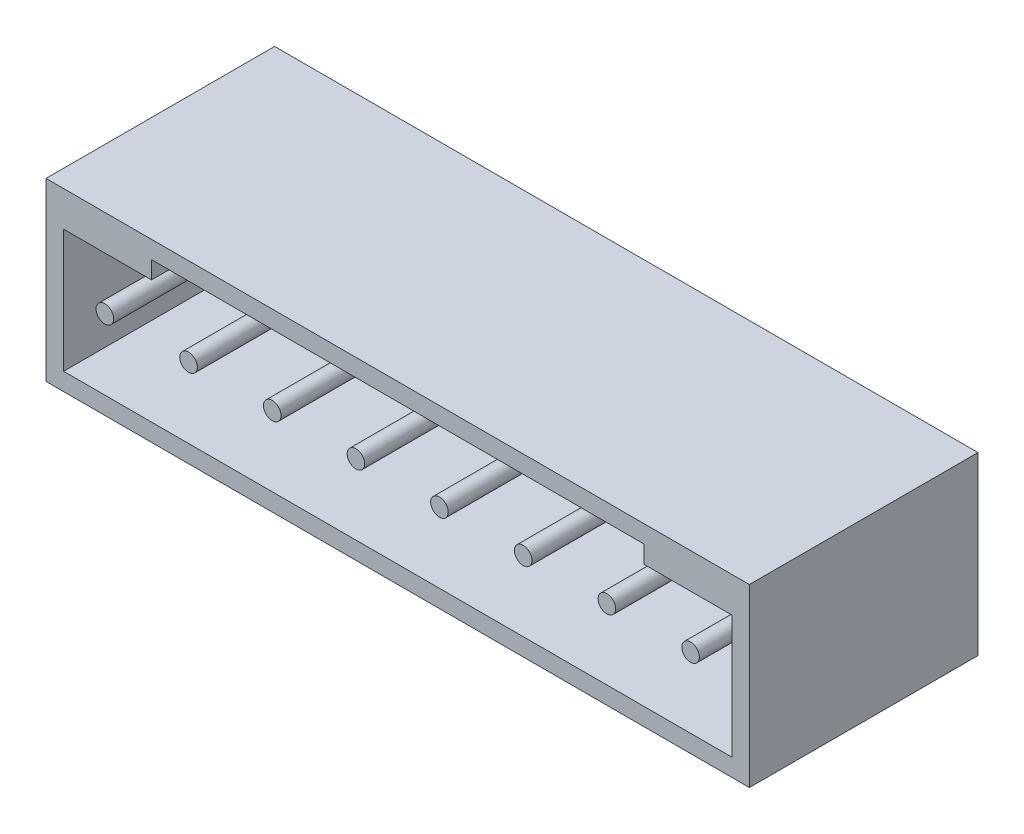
ISO-10303-21;
HEADER;
FILE_DESCRIPTION(('STEP AP214'),'2;1');
FILE_NAME('part.step','',(''),(''),'','','');
FILE_SCHEMA(('AUTOMOTIVE_DESIGN { 1 0 10303 214 1 1 1 1 }'));
ENDSEC;
DATA;
#1=APPLICATION_CONTEXT('core data for automotive mechanical design processes');
#2=APPLICATION_PROTOCOL_DEFINITION('international standard','automotive_design',2000,#1);
#3=PRODUCT_CONTEXT('',#1,'mechanical');
#4=PRODUCT('Part','Part','',(#3));
#5=PRODUCT_RELATED_PRODUCT_CATEGORY('part','',(#4));
#6=PRODUCT_DEFINITION_FORMATION('','',#4);
#7=PRODUCT_DEFINITION_CONTEXT('part definition',#1,'design');
#8=PRODUCT_DEFINITION('design','',#6,#7);
#9=PRODUCT_DEFINITION_SHAPE('','',#8);
#10=(LENGTH_UNIT() NAMED_UNIT(*) SI_UNIT(.MILLI.,.METRE.));
#11=(NAMED_UNIT(*) PLANE_ANGLE_UNIT() SI_UNIT($,.RADIAN.));
#12=(NAMED_UNIT(*) SI_UNIT($,.STERADIAN.) SOLID_ANGLE_UNIT());
#13=UNCERTAINTY_MEASURE_WITH_UNIT(LENGTH_MEASURE(1.E-05),#10,'distance_accuracy_value','');
#14=(GEOMETRIC_REPRESENTATION_CONTEXT(3) GLOBAL_UNCERTAINTY_ASSIGNED_CONTEXT((#13)) GLOBAL_UNIT_ASSIGNED_CONTEXT((#10,
#11,#12)) REPRESENTATION_CONTEXT('',''));
#15=CARTESIAN_POINT('',(0.,0.,0.));
#16=DIRECTION('',(0.,0.,1.));
#17=DIRECTION('',(1.,0.,0.));
#18=AXIS2_PLACEMENT_3D('',#15,#16,#17);
#19=CARTESIAN_POINT('',(0.,0.,6.));
#20=DIRECTION('',(0.,0.,1.));
#21=DIRECTION('',(1.,0.,0.));
#22=AXIS2_PLACEMENT_3D('',#19,#20,#21);
#23=PLANE('',#22);
#24=DIRECTION('',(0.,1.,0.));
#25=VECTOR('',#24,1.);
#26=CARTESIAN_POINT('',(10.,2.5,6.));
#27=LINE('',#26,#25);
#28=CARTESIAN_POINT('',(10.,-2.5,6.));
#29=VERTEX_POINT('',#28);
#30=CARTESIAN_POINT('',(10.,2.5,6.));
#31=VERTEX_POINT('',#30);
#32=EDGE_CURVE('E129',#29,#31,#27,.T.);
#33=ORIENTED_EDGE('',*,*,#32,.T.);
#34=DIRECTION('',(-1.,0.,0.));
#35=VECTOR('',#34,1.);
#36=CARTESIAN_POINT('',(-9.99999999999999,2.5,6.));
#37=LINE('',#36,#35);
#38=CARTESIAN_POINT('',(-9.99999999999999,2.5,6.));
#39=VERTEX_POINT('',#38);
#40=EDGE_CURVE('E212',#31,#39,#37,.T.);
#41=ORIENTED_EDGE('',*,*,#40,.T.);
#42=DIRECTION('',(0.,-1.,0.));
#43=VECTOR('',#42,1.);
#44=CARTESIAN_POINT('',(-9.99999999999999,2.5,6.));
#45=LINE('',#44,#43);
#46=CARTESIAN_POINT('',(-10.,-2.5,6.));
#47=VERTEX_POINT('',#46);
#48=EDGE_CURVE('E214',#39,#47,#45,.T.);
#49=ORIENTED_EDGE('',*,*,#48,.T.);
#50=DIRECTION('',(1.,0.,0.));
#51=VECTOR('',#50,1.);
#52=CARTESIAN_POINT('',(-10.,-2.5,6.));
#53=LINE('',#52,#51);
#54=EDGE_CURVE('E57',#47,#29,#53,.T.);
#55=ORIENTED_EDGE('',*,*,#54,.T.);
#56=EDGE_LOOP('',(#33,#41,#49,#55));
#57=FACE_BOUND('',#56,.T.);
#58=DIRECTION('',(0.,1.,0.));
#59=VECTOR('',#58,1.);
#60=CARTESIAN_POINT('',(9.5,-2.,6.));
#61=LINE('',#60,#59);
#62=CARTESIAN_POINT('',(9.5,-2.,6.));
#63=VERTEX_POINT('',#62);
#64=CARTESIAN_POINT('',(9.5,1.5,6.));
#65=VERTEX_POINT('',#64);
#66=EDGE_CURVE('E158',#63,#65,#61,.T.);
#67=ORIENTED_EDGE('',*,*,#66,.F.);
#68=DIRECTION('',(1.,0.,0.));
#69=VECTOR('',#68,1.);
#70=CARTESIAN_POINT('',(-9.5,-2.,6.));
#71=LINE('',#70,#69);
#72=CARTESIAN_POINT('',(-9.5,-2.,6.));
#73=VERTEX_POINT('',#72);
#74=EDGE_CURVE('E156',#73,#63,#71,.T.);
#75=ORIENTED_EDGE('',*,*,#74,.F.);
#76=DIRECTION('',(0.,-1.,0.));
#77=VECTOR('',#76,1.);
#78=CARTESIAN_POINT('',(-9.5,-2.,6.));
#79=LINE('',#78,#77);
#80=CARTESIAN_POINT('',(-9.5,1.5,6.));
#81=VERTEX_POINT('',#80);
#82=EDGE_CURVE('E171',#81,#73,#79,.T.);
#83=ORIENTED_EDGE('',*,*,#82,.F.);
#84=DIRECTION('',(-1.,0.,0.));
#85=VECTOR('',#84,1.);
#86=CARTESIAN_POINT('',(-9.5,1.5,6.));
#87=LINE('',#86,#85);
#88=CARTESIAN_POINT('',(-7.,1.5,6.));
#89=VERTEX_POINT('',#88);
#90=EDGE_CURVE('E169',#89,#81,#87,.T.);
#91=ORIENTED_EDGE('',*,*,#90,.F.);
#92=DIRECTION('',(0.,-1.,0.));
#93=VECTOR('',#92,1.);
#94=CARTESIAN_POINT('',(-7.,1.5,6.));
#95=LINE('',#94,#93);
#96=CARTESIAN_POINT('',(-7.,2.,6.));
#97=VERTEX_POINT('',#96);
#98=EDGE_CURVE('E167',#97,#89,#95,.T.);
#99=ORIENTED_EDGE('',*,*,#98,.F.);
#100=DIRECTION('',(-1.,0.,0.));
#101=VECTOR('',#100,1.);
#102=CARTESIAN_POINT('',(-7.,2.,6.));
#103=LINE('',#102,#101);
#104=CARTESIAN_POINT('',(7.,2.,6.));
#105=VERTEX_POINT('',#104);
#106=EDGE_CURVE('E165',#105,#97,#103,.T.);
#107=ORIENTED_EDGE('',*,*,#106,.F.);
#108=DIRECTION('',(0.,1.,0.));
#109=VECTOR('',#108,1.);
#110=CARTESIAN_POINT('',(7.,1.5,6.));
#111=LINE('',#110,#109);
#112=CARTESIAN_POINT('',(7.,1.5,6.));
#113=VERTEX_POINT('',#112);
#114=EDGE_CURVE('E163',#113,#105,#111,.T.);
#115=ORIENTED_EDGE('',*,*,#114,.F.);
#116=DIRECTION('',(-1.,0.,0.));
#117=VECTOR('',#116,1.);
#118=CARTESIAN_POINT('',(9.5,1.5,6.));
#119=LINE('',#118,#117);
#120=EDGE_CURVE('E161',#65,#113,#119,.T.);
#121=ORIENTED_EDGE('',*,*,#120,.F.);
#122=EDGE_LOOP('',(#67,#75,#83,#91,#99,#107,#115,#121));
#123=FACE_BOUND('',#122,.T.);
#124=ADVANCED_FACE('F34',(#57,#123),#23,.T.);
#125=CARTESIAN_POINT('',(10.,2.5,6.));
#126=DIRECTION('',(-1.,0.,0.));
#127=DIRECTION('',(0.,-1.,0.));
#128=AXIS2_PLACEMENT_3D('',#125,#126,#127);
#129=PLANE('',#128);
#130=DIRECTION('',(0.,0.,-1.));
#131=VECTOR('',#130,1.);
#132=CARTESIAN_POINT('',(10.,-2.5,6.));
#133=LINE('',#132,#131);
#134=CARTESIAN_POINT('',(10.,-2.5,-0.5));
#135=VERTEX_POINT('',#134);
#136=EDGE_CURVE('E124',#29,#135,#133,.T.);
#137=ORIENTED_EDGE('',*,*,#136,.T.);
#138=DIRECTION('',(0.,-1.,0.));
#139=VECTOR('',#138,1.);
#140=CARTESIAN_POINT('',(10.,2.5,-0.5));
#141=LINE('',#140,#139);
#142=CARTESIAN_POINT('',(10.,2.5,-0.5));
#143=VERTEX_POINT('',#142);
#144=EDGE_CURVE('E128',#143,#135,#141,.T.);
#145=ORIENTED_EDGE('',*,*,#144,.F.);
#146=DIRECTION('',(0.,0.,-1.));
#147=VECTOR('',#146,1.);
#148=CARTESIAN_POINT('',(10.,2.5,6.));
#149=LINE('',#148,#147);
#150=EDGE_CURVE('E220',#31,#143,#149,.T.);
#151=ORIENTED_EDGE('',*,*,#150,.F.);
#152=ORIENTED_EDGE('',*,*,#32,.F.);
#153=EDGE_LOOP('',(#137,#145,#151,#152));
#154=FACE_BOUND('',#153,.T.);
#155=ADVANCED_FACE('F36',(#154),#129,.F.);
#156=CARTESIAN_POINT('',(-9.99999999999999,2.5,6.));
#157=DIRECTION('',(0.,-1.,0.));
#158=DIRECTION('',(0.,0.,-1.));
#159=AXIS2_PLACEMENT_3D('',#156,#157,#158);
#160=PLANE('',#159);
#161=ORIENTED_EDGE('',*,*,#150,.T.);
#162=DIRECTION('',(1.,0.,0.));
#163=VECTOR('',#162,1.);
#164=CARTESIAN_POINT('',(10.,2.5,-0.5));
#165=LINE('',#164,#163);
#166=CARTESIAN_POINT('',(-10.,2.5,-0.5));
#167=VERTEX_POINT('',#166);
#168=EDGE_CURVE('E145',#167,#143,#165,.T.);
#169=ORIENTED_EDGE('',*,*,#168,.F.);
#170=DIRECTION('',(0.,0.,-1.));
#171=VECTOR('',#170,1.);
#172=CARTESIAN_POINT('',(-9.99999999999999,2.5,6.));
#173=LINE('',#172,#171);
#174=EDGE_CURVE('E218',#39,#167,#173,.T.);
#175=ORIENTED_EDGE('',*,*,#174,.F.);
#176=ORIENTED_EDGE('',*,*,#40,.F.);
#177=EDGE_LOOP('',(#161,#169,#175,#176));
#178=FACE_BOUND('',#177,.T.);
#179=ADVANCED_FACE('F309',(#178),#160,.F.);
#180=CARTESIAN_POINT('',(-9.99999999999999,2.5,6.));
#181=DIRECTION('',(1.,0.,0.));
#182=DIRECTION('',(0.,1.,0.));
#183=AXIS2_PLACEMENT_3D('',#180,#181,#182);
#184=PLANE('',#183);
#185=ORIENTED_EDGE('',*,*,#174,.T.);
#186=DIRECTION('',(0.,1.,0.));
#187=VECTOR('',#186,1.);
#188=CARTESIAN_POINT('',(-10.,2.5,-0.5));
#189=LINE('',#188,#187);
#190=CARTESIAN_POINT('',(-10.,-2.5,-0.5));
#191=VERTEX_POINT('',#190);
#192=EDGE_CURVE('E140',#191,#167,#189,.T.);
#193=ORIENTED_EDGE('',*,*,#192,.F.);
#194=DIRECTION('',(0.,0.,-1.));
#195=VECTOR('',#194,1.);
#196=CARTESIAN_POINT('',(-10.,-2.5,6.));
#197=LINE('',#196,#195);
#198=EDGE_CURVE('E131',#47,#191,#197,.T.);
#199=ORIENTED_EDGE('',*,*,#198,.F.);
#200=ORIENTED_EDGE('',*,*,#48,.F.);
#201=EDGE_LOOP('',(#185,#193,#199,#200));
#202=FACE_BOUND('',#201,.T.);
#203=ADVANCED_FACE('F315',(#202),#184,.F.);
#204=CARTESIAN_POINT('',(-10.,-2.5,6.));
#205=DIRECTION('',(0.,1.,0.));
#206=DIRECTION('',(0.,0.,1.));
#207=AXIS2_PLACEMENT_3D('',#204,#205,#206);
#208=PLANE('',#207);
#209=ORIENTED_EDGE('',*,*,#198,.T.);
#210=DIRECTION('',(-1.,0.,0.));
#211=VECTOR('',#210,1.);
#212=CARTESIAN_POINT('',(10.,-2.5,-0.5));
#213=LINE('',#212,#211);
#214=EDGE_CURVE('E134',#135,#191,#213,.T.);
#215=ORIENTED_EDGE('',*,*,#214,.F.);
#216=ORIENTED_EDGE('',*,*,#136,.F.);
#217=ORIENTED_EDGE('',*,*,#54,.F.);
#218=EDGE_LOOP('',(#209,#215,#216,#217));
#219=FACE_BOUND('',#218,.T.);
#220=ADVANCED_FACE('F135',(#219),#208,.F.);
#221=CARTESIAN_POINT('',(-9.5,-2.,6.));
#222=DIRECTION('',(0.,1.,0.));
#223=DIRECTION('',(0.,0.,1.));
#224=AXIS2_PLACEMENT_3D('',#221,#222,#223);
#225=PLANE('',#224);
#226=DIRECTION('',(1.,0.,0.));
#227=VECTOR('',#226,1.);
#228=CARTESIAN_POINT('',(-9.5,-2.,0.));
#229=LINE('',#228,#227);
#230=CARTESIAN_POINT('',(-9.5,-2.,0.));
#231=VERTEX_POINT('',#230);
#232=CARTESIAN_POINT('',(9.5,-2.,0.));
#233=VERTEX_POINT('',#232);
#234=EDGE_CURVE('E155',#231,#233,#229,.T.);
#235=ORIENTED_EDGE('',*,*,#234,.F.);
#236=DIRECTION('',(0.,0.,-1.));
#237=VECTOR('',#236,1.);
#238=CARTESIAN_POINT('',(-9.5,-2.,6.));
#239=LINE('',#238,#237);
#240=EDGE_CURVE('E173',#73,#231,#239,.T.);
#241=ORIENTED_EDGE('',*,*,#240,.F.);
#242=ORIENTED_EDGE('',*,*,#74,.T.);
#243=DIRECTION('',(0.,0.,-1.));
#244=VECTOR('',#243,1.);
#245=CARTESIAN_POINT('',(9.5,-2.,6.));
#246=LINE('',#245,#244);
#247=EDGE_CURVE('E208',#63,#233,#246,.T.);
#248=ORIENTED_EDGE('',*,*,#247,.T.);
#249=EDGE_LOOP('',(#235,#241,#242,#248));
#250=FACE_BOUND('',#249,.T.);
#251=ADVANCED_FACE('F265',(#250),#225,.T.);
#252=CARTESIAN_POINT('',(9.5,-2.,6.));
#253=DIRECTION('',(-1.,0.,0.));
#254=DIRECTION('',(0.,0.,1.));
#255=AXIS2_PLACEMENT_3D('',#252,#253,#254);
#256=PLANE('',#255);
#257=DIRECTION('',(0.,1.,0.));
#258=VECTOR('',#257,1.);
#259=CARTESIAN_POINT('',(9.5,-2.,0.));
#260=LINE('',#259,#258);
#261=CARTESIAN_POINT('',(9.5,1.5,0.));
#262=VERTEX_POINT('',#261);
#263=EDGE_CURVE('E176',#233,#262,#260,.T.);
#264=ORIENTED_EDGE('',*,*,#263,.F.);
#265=ORIENTED_EDGE('',*,*,#247,.F.);
#266=ORIENTED_EDGE('',*,*,#66,.T.);
#267=DIRECTION('',(0.,0.,-1.));
#268=VECTOR('',#267,1.);
#269=CARTESIAN_POINT('',(9.5,1.5,6.));
#270=LINE('',#269,#268);
#271=EDGE_CURVE('E206',#65,#262,#270,.T.);
#272=ORIENTED_EDGE('',*,*,#271,.T.);
#273=EDGE_LOOP('',(#264,#265,#266,#272));
#274=FACE_BOUND('',#273,.T.);
#275=ADVANCED_FACE('F270',(#274),#256,.T.);
#276=CARTESIAN_POINT('',(9.5,1.5,6.));
#277=DIRECTION('',(0.,-1.,0.));
#278=DIRECTION('',(0.,0.,-1.));
#279=AXIS2_PLACEMENT_3D('',#276,#277,#278);
#280=PLANE('',#279);
#281=DIRECTION('',(-1.,0.,0.));
#282=VECTOR('',#281,1.);
#283=CARTESIAN_POINT('',(9.5,1.5,0.));
#284=LINE('',#283,#282);
#285=CARTESIAN_POINT('',(7.,1.5,0.));
#286=VERTEX_POINT('',#285);
#287=EDGE_CURVE('E179',#262,#286,#284,.T.);
#288=ORIENTED_EDGE('',*,*,#287,.F.);
#289=ORIENTED_EDGE('',*,*,#271,.F.);
#290=ORIENTED_EDGE('',*,*,#120,.T.);
#291=DIRECTION('',(0.,0.,-1.));
#292=VECTOR('',#291,1.);
#293=CARTESIAN_POINT('',(7.,1.5,6.));
#294=LINE('',#293,#292);
#295=EDGE_CURVE('E204',#113,#286,#294,.T.);
#296=ORIENTED_EDGE('',*,*,#295,.T.);
#297=EDGE_LOOP('',(#288,#289,#290,#296));
#298=FACE_BOUND('',#297,.T.);
#299=ADVANCED_FACE('F280',(#298),#280,.T.);
#300=CARTESIAN_POINT('',(7.,1.5,6.));
#301=DIRECTION('',(-1.,0.,0.));
#302=DIRECTION('',(0.,0.,1.));
#303=AXIS2_PLACEMENT_3D('',#300,#301,#302);
#304=PLANE('',#303);
#305=DIRECTION('',(0.,1.,0.));
#306=VECTOR('',#305,1.);
#307=CARTESIAN_POINT('',(7.,1.5,0.));
#308=LINE('',#307,#306);
#309=CARTESIAN_POINT('',(7.,2.,0.));
#310=VERTEX_POINT('',#309);
#311=EDGE_CURVE('E182',#286,#310,#308,.T.);
#312=ORIENTED_EDGE('',*,*,#311,.F.);
#313=ORIENTED_EDGE('',*,*,#295,.F.);
#314=ORIENTED_EDGE('',*,*,#114,.T.);
#315=DIRECTION('',(0.,0.,-1.));
#316=VECTOR('',#315,1.);
#317=CARTESIAN_POINT('',(7.,2.,6.));
#318=LINE('',#317,#316);
#319=EDGE_CURVE('E202',#105,#310,#318,.T.);
#320=ORIENTED_EDGE('',*,*,#319,.T.);
#321=EDGE_LOOP('',(#312,#313,#314,#320));
#322=FACE_BOUND('',#321,.T.);
#323=ADVANCED_FACE('F283',(#322),#304,.T.);
#324=CARTESIAN_POINT('',(-7.,2.,6.));
#325=DIRECTION('',(0.,-1.,0.));
#326=DIRECTION('',(0.,0.,-1.));
#327=AXIS2_PLACEMENT_3D('',#324,#325,#326);
#328=PLANE('',#327);
#329=DIRECTION('',(-1.,0.,0.));
#330=VECTOR('',#329,1.);
#331=CARTESIAN_POINT('',(-7.,2.,0.));
#332=LINE('',#331,#330);
#333=CARTESIAN_POINT('',(-7.,2.,0.));
#334=VERTEX_POINT('',#333);
#335=EDGE_CURVE('E185',#310,#334,#332,.T.);
#336=ORIENTED_EDGE('',*,*,#335,.F.);
#337=ORIENTED_EDGE('',*,*,#319,.F.);
#338=ORIENTED_EDGE('',*,*,#106,.T.);
#339=DIRECTION('',(0.,0.,-1.));
#340=VECTOR('',#339,1.);
#341=CARTESIAN_POINT('',(-7.,2.,6.));
#342=LINE('',#341,#340);
#343=EDGE_CURVE('E200',#97,#334,#342,.T.);
#344=ORIENTED_EDGE('',*,*,#343,.T.);
#345=EDGE_LOOP('',(#336,#337,#338,#344));
#346=FACE_BOUND('',#345,.T.);
#347=ADVANCED_FACE('F288',(#346),#328,.T.);
#348=CARTESIAN_POINT('',(-7.,1.5,6.));
#349=DIRECTION('',(1.,0.,0.));
#350=DIRECTION('',(0.,0.,-1.));
#351=AXIS2_PLACEMENT_3D('',#348,#349,#350);
#352=PLANE('',#351);
#353=DIRECTION('',(0.,-1.,0.));
#354=VECTOR('',#353,1.);
#355=CARTESIAN_POINT('',(-7.,1.5,0.));
#356=LINE('',#355,#354);
#357=CARTESIAN_POINT('',(-7.,1.5,0.));
#358=VERTEX_POINT('',#357);
#359=EDGE_CURVE('E188',#334,#358,#356,.T.);
#360=ORIENTED_EDGE('',*,*,#359,.F.);
#361=ORIENTED_EDGE('',*,*,#343,.F.);
#362=ORIENTED_EDGE('',*,*,#98,.T.);
#363=DIRECTION('',(0.,0.,-1.));
#364=VECTOR('',#363,1.);
#365=CARTESIAN_POINT('',(-7.,1.5,6.));
#366=LINE('',#365,#364);
#367=EDGE_CURVE('E198',#89,#358,#366,.T.);
#368=ORIENTED_EDGE('',*,*,#367,.T.);
#369=EDGE_LOOP('',(#360,#361,#362,#368));
#370=FACE_BOUND('',#369,.T.);
#371=ADVANCED_FACE('F292',(#370),#352,.T.);
#372=CARTESIAN_POINT('',(-9.5,1.5,6.));
#373=DIRECTION('',(0.,-1.,0.));
#374=DIRECTION('',(0.,0.,-1.));
#375=AXIS2_PLACEMENT_3D('',#372,#373,#374);
#376=PLANE('',#375);
#377=DIRECTION('',(-1.,0.,0.));
#378=VECTOR('',#377,1.);
#379=CARTESIAN_POINT('',(-9.5,1.5,0.));
#380=LINE('',#379,#378);
#381=CARTESIAN_POINT('',(-9.5,1.5,0.));
#382=VERTEX_POINT('',#381);
#383=EDGE_CURVE('E191',#358,#382,#380,.T.);
#384=ORIENTED_EDGE('',*,*,#383,.F.);
#385=ORIENTED_EDGE('',*,*,#367,.F.);
#386=ORIENTED_EDGE('',*,*,#90,.T.);
#387=DIRECTION('',(0.,0.,-1.));
#388=VECTOR('',#387,1.);
#389=CARTESIAN_POINT('',(-9.5,1.5,6.));
#390=LINE('',#389,#388);
#391=EDGE_CURVE('E49',#81,#382,#390,.T.);
#392=ORIENTED_EDGE('',*,*,#391,.T.);
#393=EDGE_LOOP('',(#384,#385,#386,#392));
#394=FACE_BOUND('',#393,.T.);
#395=ADVANCED_FACE('F297',(#394),#376,.T.);
#396=CARTESIAN_POINT('',(-9.5,-2.,6.));
#397=DIRECTION('',(1.,0.,0.));
#398=DIRECTION('',(0.,0.,-1.));
#399=AXIS2_PLACEMENT_3D('',#396,#397,#398);
#400=PLANE('',#399);
#401=DIRECTION('',(0.,-1.,0.));
#402=VECTOR('',#401,1.);
#403=CARTESIAN_POINT('',(-9.5,-2.,0.));
#404=LINE('',#403,#402);
#405=EDGE_CURVE('E159',#382,#231,#404,.T.);
#406=ORIENTED_EDGE('',*,*,#405,.F.);
#407=ORIENTED_EDGE('',*,*,#391,.F.);
#408=ORIENTED_EDGE('',*,*,#82,.T.);
#409=ORIENTED_EDGE('',*,*,#240,.T.);
#410=EDGE_LOOP('',(#406,#407,#408,#409));
#411=FACE_BOUND('',#410,.T.);
#412=ADVANCED_FACE('F247',(#411),#400,.T.);
#413=CARTESIAN_POINT('',(0.,0.,0.));
#414=DIRECTION('',(0.,0.,-1.));
#415=DIRECTION('',(-1.,0.,0.));
#416=AXIS2_PLACEMENT_3D('',#413,#414,#415);
#417=PLANE('',#416);
#418=CARTESIAN_POINT('',(8.3275,0.,0.));
#419=DIRECTION('',(0.,0.,-1.));
#420=DIRECTION('',(-1.,0.,0.));
#421=AXIS2_PLACEMENT_3D('',#418,#419,#420);
#422=CIRCLE('',#421,0.25);
#423=CARTESIAN_POINT('',(8.0775,0.,0.));
#424=VERTEX_POINT('',#423);
#425=EDGE_CURVE('E11',#424,#424,#422,.F.);
#426=ORIENTED_EDGE('',*,*,#425,.F.);
#427=EDGE_LOOP('',(#426));
#428=FACE_BOUND('',#427,.T.);
#429=CARTESIAN_POINT('',(5.9475,0.,0.));
#430=DIRECTION('',(0.,0.,-1.));
#431=DIRECTION('',(-1.,0.,0.));
#432=AXIS2_PLACEMENT_3D('',#429,#430,#431);
#433=CIRCLE('',#432,0.25);
#434=CARTESIAN_POINT('',(5.6975,0.,0.));
#435=VERTEX_POINT('',#434);
#436=EDGE_CURVE('E42',#435,#435,#433,.F.);
#437=ORIENTED_EDGE('',*,*,#436,.F.);
#438=EDGE_LOOP('',(#437));
#439=FACE_BOUND('',#438,.T.);
#440=CARTESIAN_POINT('',(3.5675,0.,0.));
#441=DIRECTION('',(0.,0.,-1.));
#442=DIRECTION('',(-1.,0.,0.));
#443=AXIS2_PLACEMENT_3D('',#440,#441,#442);
#444=CIRCLE('',#443,0.25);
#445=CARTESIAN_POINT('',(3.3175,0.,0.));
#446=VERTEX_POINT('',#445);
#447=EDGE_CURVE('E237',#446,#446,#444,.F.);
#448=ORIENTED_EDGE('',*,*,#447,.F.);
#449=EDGE_LOOP('',(#448));
#450=FACE_BOUND('',#449,.T.);
#451=CARTESIAN_POINT('',(1.1875,0.,0.));
#452=DIRECTION('',(0.,0.,-1.));
#453=DIRECTION('',(-1.,0.,0.));
#454=AXIS2_PLACEMENT_3D('',#451,#452,#453);
#455=CIRCLE('',#454,0.25);
#456=CARTESIAN_POINT('',(0.937499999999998,0.,0.));
#457=VERTEX_POINT('',#456);
#458=EDGE_CURVE('E234',#457,#457,#455,.F.);
#459=ORIENTED_EDGE('',*,*,#458,.F.);
#460=EDGE_LOOP('',(#459));
#461=FACE_BOUND('',#460,.T.);
#462=CARTESIAN_POINT('',(-8.3275,0.,0.));
#463=DIRECTION('',(0.,0.,-1.));
#464=DIRECTION('',(-1.,0.,0.));
#465=AXIS2_PLACEMENT_3D('',#462,#463,#464);
#466=CIRCLE('',#465,0.25);
#467=CARTESIAN_POINT('',(-8.5775,0.,0.));
#468=VERTEX_POINT('',#467);
#469=EDGE_CURVE('E231',#468,#468,#466,.F.);
#470=ORIENTED_EDGE('',*,*,#469,.F.);
#471=EDGE_LOOP('',(#470));
#472=FACE_BOUND('',#471,.T.);
#473=CARTESIAN_POINT('',(-5.9475,0.,0.));
#474=DIRECTION('',(0.,0.,-1.));
#475=DIRECTION('',(-1.,0.,0.));
#476=AXIS2_PLACEMENT_3D('',#473,#474,#475);
#477=CIRCLE('',#476,0.25);
#478=CARTESIAN_POINT('',(-6.1975,0.,0.));
#479=VERTEX_POINT('',#478);
#480=EDGE_CURVE('E228',#479,#479,#477,.F.);
#481=ORIENTED_EDGE('',*,*,#480,.F.);
#482=EDGE_LOOP('',(#481));
#483=FACE_BOUND('',#482,.T.);
#484=CARTESIAN_POINT('',(-3.5675,0.,0.));
#485=DIRECTION('',(0.,0.,-1.));
#486=DIRECTION('',(-1.,0.,0.));
#487=AXIS2_PLACEMENT_3D('',#484,#485,#486);
#488=CIRCLE('',#487,0.25);
#489=CARTESIAN_POINT('',(-3.8175,0.,0.));
#490=VERTEX_POINT('',#489);
#491=EDGE_CURVE('E225',#490,#490,#488,.F.);
#492=ORIENTED_EDGE('',*,*,#491,.F.);
#493=EDGE_LOOP('',(#492));
#494=FACE_BOUND('',#493,.T.);
#495=CARTESIAN_POINT('',(-1.1875,0.,0.));
#496=DIRECTION('',(0.,0.,-1.));
#497=DIRECTION('',(-1.,0.,0.));
#498=AXIS2_PLACEMENT_3D('',#495,#496,#497);
#499=CIRCLE('',#498,0.25);
#500=CARTESIAN_POINT('',(-1.4375,0.,0.));
#501=VERTEX_POINT('',#500);
#502=EDGE_CURVE('E222',#501,#501,#499,.F.);
#503=ORIENTED_EDGE('',*,*,#502,.F.);
#504=EDGE_LOOP('',(#503));
#505=FACE_BOUND('',#504,.T.);
#506=ORIENTED_EDGE('',*,*,#234,.T.);
#507=ORIENTED_EDGE('',*,*,#263,.T.);
#508=ORIENTED_EDGE('',*,*,#287,.T.);
#509=ORIENTED_EDGE('',*,*,#311,.T.);
#510=ORIENTED_EDGE('',*,*,#335,.T.);
#511=ORIENTED_EDGE('',*,*,#359,.T.);
#512=ORIENTED_EDGE('',*,*,#383,.T.);
#513=ORIENTED_EDGE('',*,*,#405,.T.);
#514=EDGE_LOOP('',(#506,#507,#508,#509,#510,#511,#512,#513));
#515=FACE_BOUND('',#514,.T.);
#516=ADVANCED_FACE('F244',(#428,#439,#450,#461,#472,#483,#494,#505,#515),#417,.F.);
#517=CARTESIAN_POINT('',(0.,0.,-0.5));
#518=DIRECTION('',(0.,0.,-1.));
#519=DIRECTION('',(-1.,0.,0.));
#520=AXIS2_PLACEMENT_3D('',#517,#518,#519);
#521=PLANE('',#520);
#522=ORIENTED_EDGE('',*,*,#144,.T.);
#523=ORIENTED_EDGE('',*,*,#214,.T.);
#524=ORIENTED_EDGE('',*,*,#192,.T.);
#525=ORIENTED_EDGE('',*,*,#168,.T.);
#526=EDGE_LOOP('',(#522,#523,#524,#525));
#527=FACE_BOUND('',#526,.T.);
#528=ADVANCED_FACE('F143',(#527),#521,.T.);
#529=CARTESIAN_POINT('',(-1.1875,0.,6.));
#530=DIRECTION('',(0.,0.,-1.));
#531=DIRECTION('',(-1.,0.,0.));
#532=AXIS2_PLACEMENT_3D('',#529,#530,#531);
#533=CYLINDRICAL_SURFACE('',#532,0.25);
#534=CARTESIAN_POINT('',(-1.1875,0.,6.));
#535=DIRECTION('',(0.,0.,1.));
#536=DIRECTION('',(1.,0.,0.));
#537=AXIS2_PLACEMENT_3D('',#534,#535,#536);
#538=CIRCLE('',#537,0.25);
#539=CARTESIAN_POINT('',(-0.937499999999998,0.,6.));
#540=VERTEX_POINT('',#539);
#541=EDGE_CURVE('E146',#540,#540,#538,.T.);
#542=ORIENTED_EDGE('',*,*,#541,.F.);
#543=EDGE_LOOP('',(#542));
#544=FACE_BOUND('',#543,.T.);
#545=ORIENTED_EDGE('',*,*,#502,.T.);
#546=EDGE_LOOP('',(#545));
#547=FACE_BOUND('',#546,.T.);
#548=ADVANCED_FACE('F386',(#544,#547),#533,.T.);
#549=CARTESIAN_POINT('',(-1.1875,0.,6.));
#550=DIRECTION('',(0.,0.,1.));
#551=DIRECTION('',(1.,0.,0.));
#552=AXIS2_PLACEMENT_3D('',#549,#550,#551);
#553=PLANE('',#552);
#554=ORIENTED_EDGE('',*,*,#541,.T.);
#555=EDGE_LOOP('',(#554));
#556=FACE_BOUND('',#555,.T.);
#557=ADVANCED_FACE('F401',(#556),#553,.T.);
#558=CARTESIAN_POINT('',(-3.5675,0.,6.));
#559=DIRECTION('',(0.,0.,-1.));
#560=DIRECTION('',(-1.,0.,0.));
#561=AXIS2_PLACEMENT_3D('',#558,#559,#560);
#562=CYLINDRICAL_SURFACE('',#561,0.25);
#563=CARTESIAN_POINT('',(-3.5675,0.,6.));
#564=DIRECTION('',(0.,0.,1.));
#565=DIRECTION('',(1.,0.,0.));
#566=AXIS2_PLACEMENT_3D('',#563,#564,#565);
#567=CIRCLE('',#566,0.25);
#568=CARTESIAN_POINT('',(-3.3175,0.,6.));
#569=VERTEX_POINT('',#568);
#570=EDGE_CURVE('E149',#569,#569,#567,.T.);
#571=ORIENTED_EDGE('',*,*,#570,.F.);
#572=EDGE_LOOP('',(#571));
#573=FACE_BOUND('',#572,.T.);
#574=ORIENTED_EDGE('',*,*,#491,.T.);
#575=EDGE_LOOP('',(#574));
#576=FACE_BOUND('',#575,.T.);
#577=ADVANCED_FACE('F411',(#573,#576),#562,.T.);
#578=CARTESIAN_POINT('',(-3.5675,0.,6.));
#579=DIRECTION('',(0.,0.,1.));
#580=DIRECTION('',(1.,0.,0.));
#581=AXIS2_PLACEMENT_3D('',#578,#579,#580);
#582=PLANE('',#581);
#583=ORIENTED_EDGE('',*,*,#570,.T.);
#584=EDGE_LOOP('',(#583));
#585=FACE_BOUND('',#584,.T.);
#586=ADVANCED_FACE('F421',(#585),#582,.T.);
#587=CARTESIAN_POINT('',(-5.9475,0.,6.));
#588=DIRECTION('',(0.,0.,-1.));
#589=DIRECTION('',(-1.,0.,0.));
#590=AXIS2_PLACEMENT_3D('',#587,#588,#589);
#591=CYLINDRICAL_SURFACE('',#590,0.25);
#592=CARTESIAN_POINT('',(-5.9475,0.,6.));
#593=DIRECTION('',(0.,0.,1.));
#594=DIRECTION('',(1.,0.,0.));
#595=AXIS2_PLACEMENT_3D('',#592,#593,#594);
#596=CIRCLE('',#595,0.25);
#597=CARTESIAN_POINT('',(-5.6975,0.,6.));
#598=VERTEX_POINT('',#597);
#599=EDGE_CURVE('E571',#598,#598,#596,.T.);
#600=ORIENTED_EDGE('',*,*,#599,.F.);
#601=EDGE_LOOP('',(#600));
#602=FACE_BOUND('',#601,.T.);
#603=ORIENTED_EDGE('',*,*,#480,.T.);
#604=EDGE_LOOP('',(#603));
#605=FACE_BOUND('',#604,.T.);
#606=ADVANCED_FACE('F431',(#602,#605),#591,.T.);
#607=CARTESIAN_POINT('',(-5.9475,0.,6.));
#608=DIRECTION('',(0.,0.,1.));
#609=DIRECTION('',(1.,0.,0.));
#610=AXIS2_PLACEMENT_3D('',#607,#608,#609);
#611=PLANE('',#610);
#612=ORIENTED_EDGE('',*,*,#599,.T.);
#613=EDGE_LOOP('',(#612));
#614=FACE_BOUND('',#613,.T.);
#615=ADVANCED_FACE('F441',(#614),#611,.T.);
#616=CARTESIAN_POINT('',(-8.3275,0.,6.));
#617=DIRECTION('',(0.,0.,-1.));
#618=DIRECTION('',(-1.,0.,0.));
#619=AXIS2_PLACEMENT_3D('',#616,#617,#618);
#620=CYLINDRICAL_SURFACE('',#619,0.25);
#621=CARTESIAN_POINT('',(-8.3275,0.,6.));
#622=DIRECTION('',(0.,0.,1.));
#623=DIRECTION('',(1.,0.,0.));
#624=AXIS2_PLACEMENT_3D('',#621,#622,#623);
#625=CIRCLE('',#624,0.25);
#626=CARTESIAN_POINT('',(-8.0775,0.,6.));
#627=VERTEX_POINT('',#626);
#628=EDGE_CURVE('E568',#627,#627,#625,.T.);
#629=ORIENTED_EDGE('',*,*,#628,.F.);
#630=EDGE_LOOP('',(#629));
#631=FACE_BOUND('',#630,.T.);
#632=ORIENTED_EDGE('',*,*,#469,.T.);
#633=EDGE_LOOP('',(#632));
#634=FACE_BOUND('',#633,.T.);
#635=ADVANCED_FACE('F451',(#631,#634),#620,.T.);
#636=CARTESIAN_POINT('',(-8.3275,0.,6.));
#637=DIRECTION('',(0.,0.,1.));
#638=DIRECTION('',(1.,0.,0.));
#639=AXIS2_PLACEMENT_3D('',#636,#637,#638);
#640=PLANE('',#639);
#641=ORIENTED_EDGE('',*,*,#628,.T.);
#642=EDGE_LOOP('',(#641));
#643=FACE_BOUND('',#642,.T.);
#644=ADVANCED_FACE('F461',(#643),#640,.T.);
#645=CARTESIAN_POINT('',(1.1875,0.,6.));
#646=DIRECTION('',(0.,0.,-1.));
#647=DIRECTION('',(-1.,0.,0.));
#648=AXIS2_PLACEMENT_3D('',#645,#646,#647);
#649=CYLINDRICAL_SURFACE('',#648,0.25);
#650=CARTESIAN_POINT('',(1.1875,0.,6.));
#651=DIRECTION('',(0.,0.,1.));
#652=DIRECTION('',(-1.,0.,0.));
#653=AXIS2_PLACEMENT_3D('',#650,#651,#652);
#654=CIRCLE('',#653,0.25);
#655=CARTESIAN_POINT('',(0.937499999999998,0.,6.));
#656=VERTEX_POINT('',#655);
#657=EDGE_CURVE('E565',#656,#656,#654,.T.);
#658=ORIENTED_EDGE('',*,*,#657,.F.);
#659=EDGE_LOOP('',(#658));
#660=FACE_BOUND('',#659,.T.);
#661=ORIENTED_EDGE('',*,*,#458,.T.);
#662=EDGE_LOOP('',(#661));
#663=FACE_BOUND('',#662,.T.);
#664=ADVANCED_FACE('F471',(#660,#663),#649,.T.);
#665=CARTESIAN_POINT('',(1.1875,0.,6.));
#666=DIRECTION('',(0.,0.,-1.));
#667=DIRECTION('',(-1.,0.,0.));
#668=AXIS2_PLACEMENT_3D('',#665,#666,#667);
#669=PLANE('',#668);
#670=ORIENTED_EDGE('',*,*,#657,.T.);
#671=EDGE_LOOP('',(#670));
#672=FACE_BOUND('',#671,.T.);
#673=ADVANCED_FACE('F481',(#672),#669,.F.);
#674=CARTESIAN_POINT('',(3.5675,0.,6.));
#675=DIRECTION('',(0.,0.,-1.));
#676=DIRECTION('',(-1.,0.,0.));
#677=AXIS2_PLACEMENT_3D('',#674,#675,#676);
#678=CYLINDRICAL_SURFACE('',#677,0.25);
#679=CARTESIAN_POINT('',(3.5675,0.,6.));
#680=DIRECTION('',(0.,0.,1.));
#681=DIRECTION('',(-1.,0.,0.));
#682=AXIS2_PLACEMENT_3D('',#679,#680,#681);
#683=CIRCLE('',#682,0.25);
#684=CARTESIAN_POINT('',(3.3175,0.,6.));
#685=VERTEX_POINT('',#684);
#686=EDGE_CURVE('E560',#685,#685,#683,.T.);
#687=ORIENTED_EDGE('',*,*,#686,.F.);
#688=EDGE_LOOP('',(#687));
#689=FACE_BOUND('',#688,.T.);
#690=ORIENTED_EDGE('',*,*,#447,.T.);
#691=EDGE_LOOP('',(#690));
#692=FACE_BOUND('',#691,.T.);
#693=ADVANCED_FACE('F491',(#689,#692),#678,.T.);
#694=CARTESIAN_POINT('',(3.5675,0.,6.));
#695=DIRECTION('',(0.,0.,-1.));
#696=DIRECTION('',(-1.,0.,0.));
#697=AXIS2_PLACEMENT_3D('',#694,#695,#696);
#698=PLANE('',#697);
#699=ORIENTED_EDGE('',*,*,#686,.T.);
#700=EDGE_LOOP('',(#699));
#701=FACE_BOUND('',#700,.T.);
#702=ADVANCED_FACE('F501',(#701),#698,.F.);
#703=CARTESIAN_POINT('',(5.9475,0.,6.));
#704=DIRECTION('',(0.,0.,-1.));
#705=DIRECTION('',(-1.,0.,0.));
#706=AXIS2_PLACEMENT_3D('',#703,#704,#705);
#707=CYLINDRICAL_SURFACE('',#706,0.25);
#708=CARTESIAN_POINT('',(5.9475,0.,6.));
#709=DIRECTION('',(0.,0.,1.));
#710=DIRECTION('',(-1.,0.,0.));
#711=AXIS2_PLACEMENT_3D('',#708,#709,#710);
#712=CIRCLE('',#711,0.25);
#713=CARTESIAN_POINT('',(5.6975,0.,6.));
#714=VERTEX_POINT('',#713);
#715=EDGE_CURVE('E557',#714,#714,#712,.T.);
#716=ORIENTED_EDGE('',*,*,#715,.F.);
#717=EDGE_LOOP('',(#716));
#718=FACE_BOUND('',#717,.T.);
#719=ORIENTED_EDGE('',*,*,#436,.T.);
#720=EDGE_LOOP('',(#719));
#721=FACE_BOUND('',#720,.T.);
#722=ADVANCED_FACE('F242',(#718,#721),#707,.T.);
#723=CARTESIAN_POINT('',(5.9475,0.,6.));
#724=DIRECTION('',(0.,0.,-1.));
#725=DIRECTION('',(-1.,0.,0.));
#726=AXIS2_PLACEMENT_3D('',#723,#724,#725);
#727=PLANE('',#726);
#728=ORIENTED_EDGE('',*,*,#715,.T.);
#729=EDGE_LOOP('',(#728));
#730=FACE_BOUND('',#729,.T.);
#731=ADVANCED_FACE('F520',(#730),#727,.F.);
#732=CARTESIAN_POINT('',(8.3275,0.,6.));
#733=DIRECTION('',(0.,0.,-1.));
#734=DIRECTION('',(-1.,0.,0.));
#735=AXIS2_PLACEMENT_3D('',#732,#733,#734);
#736=CYLINDRICAL_SURFACE('',#735,0.25);
#737=CARTESIAN_POINT('',(8.3275,0.,6.));
#738=DIRECTION('',(0.,0.,1.));
#739=DIRECTION('',(-1.,0.,0.));
#740=AXIS2_PLACEMENT_3D('',#737,#738,#739);
#741=CIRCLE('',#740,0.25);
#742=CARTESIAN_POINT('',(8.0775,0.,6.));
#743=VERTEX_POINT('',#742);
#744=EDGE_CURVE('E556',#743,#743,#741,.T.);
#745=ORIENTED_EDGE('',*,*,#744,.F.);
#746=EDGE_LOOP('',(#745));
#747=FACE_BOUND('',#746,.T.);
#748=ORIENTED_EDGE('',*,*,#425,.T.);
#749=EDGE_LOOP('',(#748));
#750=FACE_BOUND('',#749,.T.);
#751=ADVANCED_FACE('F530',(#747,#750),#736,.T.);
#752=CARTESIAN_POINT('',(8.3275,0.,6.));
#753=DIRECTION('',(0.,0.,-1.));
#754=DIRECTION('',(-1.,0.,0.));
#755=AXIS2_PLACEMENT_3D('',#752,#753,#754);
#756=PLANE('',#755);
#757=ORIENTED_EDGE('',*,*,#744,.T.);
#758=EDGE_LOOP('',(#757));
#759=FACE_BOUND('',#758,.T.);
#760=ADVANCED_FACE('F540',(#759),#756,.F.);
#761=CLOSED_SHELL('',(#124,#155,#179,#203,#220,#251,#275,#299,#323,#347,#371,#395,#412,#516,
#528,#548,#557,#577,#586,#606,#615,#635,#644,#664,#673,#693,#702,#722,#731,#751,#760));
#762=MANIFOLD_SOLID_BREP('B2',#761);
#763=ADVANCED_BREP_SHAPE_REPRESENTATION('',(#18,#762),#14);
#764=SHAPE_DEFINITION_REPRESENTATION(#9,#763);
ENDSEC;
END-ISO-10303-21;
